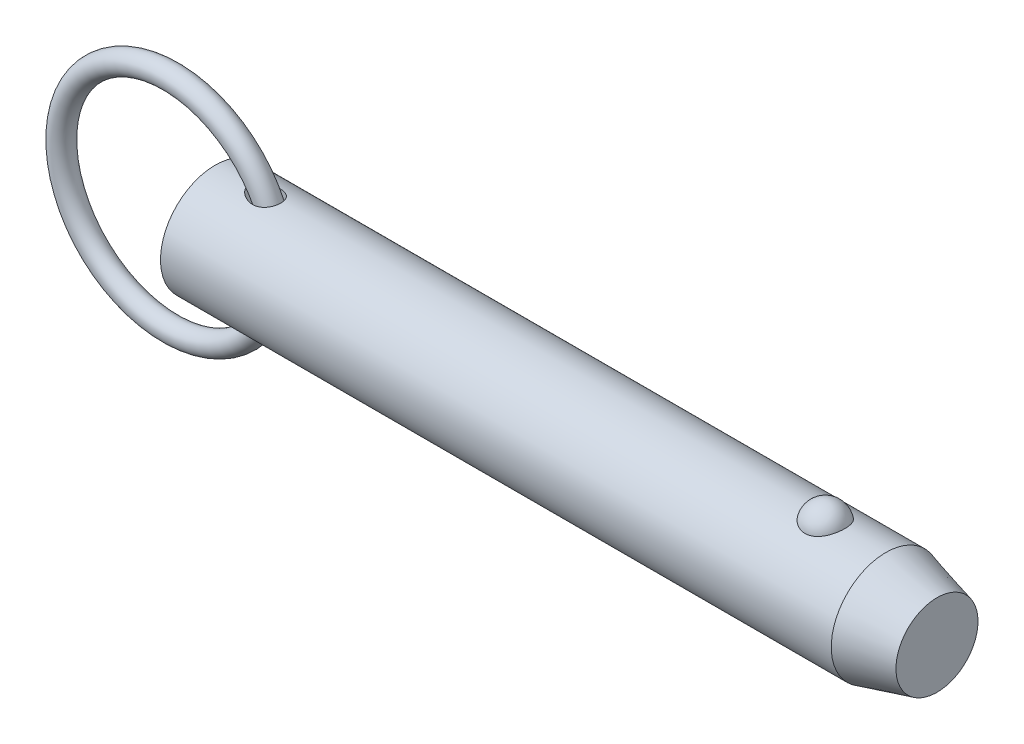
ISO-10303-21;
HEADER;
FILE_DESCRIPTION(('STEP AP214'),'2;1');
FILE_NAME('part.step','',(''),(''),'','','');
FILE_SCHEMA(('AUTOMOTIVE_DESIGN { 1 0 10303 214 1 1 1 1 }'));
ENDSEC;
DATA;
#1=APPLICATION_CONTEXT('core data for automotive mechanical design processes');
#2=APPLICATION_PROTOCOL_DEFINITION('international standard','automotive_design',2000,#1);
#3=PRODUCT_CONTEXT('',#1,'mechanical');
#4=PRODUCT('Part','Part','',(#3));
#5=PRODUCT_RELATED_PRODUCT_CATEGORY('part','',(#4));
#6=PRODUCT_DEFINITION_FORMATION('','',#4);
#7=PRODUCT_DEFINITION_CONTEXT('part definition',#1,'design');
#8=PRODUCT_DEFINITION('design','',#6,#7);
#9=PRODUCT_DEFINITION_SHAPE('','',#8);
#10=(LENGTH_UNIT() NAMED_UNIT(*) SI_UNIT(.MILLI.,.METRE.));
#11=(NAMED_UNIT(*) PLANE_ANGLE_UNIT() SI_UNIT($,.RADIAN.));
#12=(NAMED_UNIT(*) SI_UNIT($,.STERADIAN.) SOLID_ANGLE_UNIT());
#13=UNCERTAINTY_MEASURE_WITH_UNIT(LENGTH_MEASURE(1.E-05),#10,'distance_accuracy_value','');
#14=(GEOMETRIC_REPRESENTATION_CONTEXT(3) GLOBAL_UNCERTAINTY_ASSIGNED_CONTEXT((#13)) GLOBAL_UNIT_ASSIGNED_CONTEXT((#10,
#11,#12)) REPRESENTATION_CONTEXT('',''));
#15=CARTESIAN_POINT('',(0.,0.,0.));
#16=DIRECTION('',(0.,0.,1.));
#17=DIRECTION('',(1.,0.,0.));
#18=AXIS2_PLACEMENT_3D('',#15,#16,#17);
#19=CARTESIAN_POINT('',(-6.46799987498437,0.,0.));
#20=DIRECTION('',(0.,0.,1.));
#21=DIRECTION('',(1.,0.,0.));
#22=AXIS2_PLACEMENT_3D('',#19,#20,#21);
#23=TOROIDAL_SURFACE('',#22,15.875,1.588);
#24=CARTESIAN_POINT('',(10.9950001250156,0.,0.));
#25=VERTEX_POINT('',#24);
#26=VERTEX_LOOP('',#25);
#27=FACE_BOUND('',#26,.T.);
#28=ADVANCED_FACE('P0_F12',(#27),#23,.T.);
#29=CLOSED_SHELL('',(#28));
#30=MANIFOLD_SOLID_BREP('P0_B1',#29);
#31=CARTESIAN_POINT('',(0.,0.,0.));
#32=DIRECTION('',(1.,0.,0.));
#33=DIRECTION('',(0.,0.,-1.));
#34=AXIS2_PLACEMENT_3D('',#31,#32,#33);
#35=CYLINDRICAL_SURFACE('',#34,7.94);
#36=CARTESIAN_POINT('',(5.37881269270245,7.8641200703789,-1.0950869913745));
#37=CARTESIAN_POINT('',(5.49078530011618,7.84653010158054,-1.22142628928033));
#38=CARTESIAN_POINT('',(5.61742164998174,7.82766483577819,-1.33478448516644));
#39=CARTESIAN_POINT('',(5.82155225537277,7.80005811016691,-1.48501770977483));
#40=CARTESIAN_POINT('',(5.89211597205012,7.79095331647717,-1.53186949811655));
#41=CARTESIAN_POINT('',(6.03726296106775,7.77331484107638,-1.61899652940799));
#42=CARTESIAN_POINT('',(6.11184478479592,7.76478095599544,-1.65927412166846));
#43=CARTESIAN_POINT('',(6.31831542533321,7.74290334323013,-1.75933205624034));
#44=CARTESIAN_POINT('',(6.45343253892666,7.73042593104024,-1.81276183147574));
#45=CARTESIAN_POINT('',(6.73017339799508,7.70966096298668,-1.89912673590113));
#46=CARTESIAN_POINT('',(6.8717909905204,7.70136953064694,-1.93208083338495));
#47=CARTESIAN_POINT('',(7.17522096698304,7.6896684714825,-1.97820987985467));
#48=CARTESIAN_POINT('',(7.33750100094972,7.68691980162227,-1.98871513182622));
#49=CARTESIAN_POINT('',(7.5799424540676,7.68880305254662,-1.98137951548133));
#50=CARTESIAN_POINT('',(7.66059155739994,7.69043175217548,-1.97508575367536));
#51=CARTESIAN_POINT('',(7.82077465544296,7.69570110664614,-1.95445819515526));
#52=CARTESIAN_POINT('',(7.9003091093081,7.69934090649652,-1.94012781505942));
#53=CARTESIAN_POINT('',(8.09280087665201,7.71066069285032,-1.89475688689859));
#54=CARTESIAN_POINT('',(8.20465204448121,7.71942251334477,-1.85909462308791));
#55=CARTESIAN_POINT('',(8.42059371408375,7.74035594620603,-1.7699066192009));
#56=CARTESIAN_POINT('',(8.52468939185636,7.75252525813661,-1.7163929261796));
#57=CARTESIAN_POINT('',(8.72211003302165,7.77903750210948,-1.59192358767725));
#58=CARTESIAN_POINT('',(8.81539818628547,7.79338749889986,-1.52091076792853));
#59=CARTESIAN_POINT('',(8.98759177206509,7.8225086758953,-1.36321590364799));
#60=CARTESIAN_POINT('',(9.06649712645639,7.83727985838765,-1.27653377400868));
#61=CARTESIAN_POINT('',(9.20311499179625,7.86453692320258,-1.09567667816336));
#62=CARTESIAN_POINT('',(9.26180839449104,7.8771064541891,-1.00225329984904));
#63=CARTESIAN_POINT('',(9.36257622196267,7.89954213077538,-0.806547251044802));
#64=CARTESIAN_POINT('',(9.40465301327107,7.9094086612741,-0.704265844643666));
#65=CARTESIAN_POINT('',(9.47062404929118,7.92520709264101,-0.49546189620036));
#66=CARTESIAN_POINT('',(9.4947881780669,7.9311972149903,-0.389028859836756));
#67=CARTESIAN_POINT('',(9.52544004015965,7.93883641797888,-0.173494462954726));
#68=CARTESIAN_POINT('',(9.53192786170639,7.94048552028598,-0.0643931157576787));
#69=CARTESIAN_POINT('',(9.52707996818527,7.93926454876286,0.153487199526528));
#70=CARTESIAN_POINT('',(9.51572796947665,7.93639034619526,0.26226578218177));
#71=CARTESIAN_POINT('',(9.47542322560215,7.92642470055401,0.476313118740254));
#72=CARTESIAN_POINT('',(9.44647056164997,7.91933327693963,0.58158188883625));
#73=CARTESIAN_POINT('',(9.37164011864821,7.90170355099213,0.785602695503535));
#74=CARTESIAN_POINT('',(9.32576415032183,7.89116561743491,0.884355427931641));
#75=CARTESIAN_POINT('',(9.21823065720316,7.8677977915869,1.07254831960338));
#76=CARTESIAN_POINT('',(9.15657431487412,7.85496807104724,1.16198917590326));
#77=CARTESIAN_POINT('',(9.01919194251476,7.82843688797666,1.32903649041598));
#78=CARTESIAN_POINT('',(8.94347744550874,7.81473614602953,1.40665255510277));
#79=CARTESIAN_POINT('',(8.78012086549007,7.7879321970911,1.5481977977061));
#80=CARTESIAN_POINT('',(8.69247914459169,7.77482897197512,1.61212739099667));
#81=CARTESIAN_POINT('',(8.50642314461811,7.75037063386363,1.72592270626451));
#82=CARTESIAN_POINT('',(8.40786430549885,7.73904540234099,1.77555777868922));
#83=CARTESIAN_POINT('',(8.2039870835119,7.71943979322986,1.85894844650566));
#84=CARTESIAN_POINT('',(8.0986670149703,7.7111601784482,1.89270006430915));
#85=CARTESIAN_POINT('',(7.87703213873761,7.69782475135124,1.94625652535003));
#86=CARTESIAN_POINT('',(7.76044899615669,7.69301557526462,1.96500324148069));
#87=CARTESIAN_POINT('',(7.52574256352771,7.68770484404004,1.98567257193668));
#88=CARTESIAN_POINT('',(7.40761868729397,7.68720497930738,1.98758858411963));
#89=CARTESIAN_POINT('',(7.15639592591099,7.69044495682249,1.97502233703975));
#90=CARTESIAN_POINT('',(7.02341871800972,7.69476380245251,1.9583009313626));
#91=CARTESIAN_POINT('',(6.76125891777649,7.70776394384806,1.90648094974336));
#92=CARTESIAN_POINT('',(6.6320804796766,7.71644984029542,1.87136299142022));
#93=CARTESIAN_POINT('',(6.35978215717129,7.73875442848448,1.77707737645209));
#94=CARTESIAN_POINT('',(6.2177212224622,7.75293863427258,1.71496895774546));
#95=CARTESIAN_POINT('',(5.94559201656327,7.78383102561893,1.56880760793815));
#96=CARTESIAN_POINT('',(5.81552062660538,7.80053855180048,1.48476040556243));
#97=CARTESIAN_POINT('',(5.60081087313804,7.83035955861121,1.31701356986));
#98=CARTESIAN_POINT('',(5.51265224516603,7.84340226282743,1.23780647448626));
#99=CARTESIAN_POINT('',(5.34976240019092,7.86852524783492,1.06647953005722));
#100=CARTESIAN_POINT('',(5.27500719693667,7.88060722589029,0.974383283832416));
#101=CARTESIAN_POINT('',(5.15877594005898,7.89990441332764,0.800548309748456));
#102=CARTESIAN_POINT('',(5.11360209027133,7.90759876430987,0.721348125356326));
#103=CARTESIAN_POINT('',(5.03655060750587,7.92090267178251,0.55651819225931));
#104=CARTESIAN_POINT('',(5.00466157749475,7.92651401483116,0.470894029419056));
#105=CARTESIAN_POINT('',(4.95653766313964,7.93503671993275,0.294356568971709));
#106=CARTESIAN_POINT('',(4.94043621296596,7.93792505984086,0.203404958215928));
#107=CARTESIAN_POINT('',(4.92605720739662,7.94050250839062,0.0200631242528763));
#108=CARTESIAN_POINT('',(4.92776929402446,7.9401934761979,-0.0723262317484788));
#109=CARTESIAN_POINT('',(4.94742735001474,7.93667454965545,-0.243250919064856));
#110=CARTESIAN_POINT('',(4.96327131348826,7.93384031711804,-0.322048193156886));
#111=CARTESIAN_POINT('',(5.00707570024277,7.92609115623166,-0.476058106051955));
#112=CARTESIAN_POINT('',(5.03503965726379,7.92117562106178,-0.55126969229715));
#113=CARTESIAN_POINT('',(5.10737112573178,7.90866290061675,-0.709995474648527));
#114=CARTESIAN_POINT('',(5.15379379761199,7.90074105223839,-0.792541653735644));
#115=CARTESIAN_POINT('',(5.2582083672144,7.88338732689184,-0.949781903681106));
#116=CARTESIAN_POINT('',(5.31621941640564,7.87395295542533,-1.02446265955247));
#117=CARTESIAN_POINT('',(5.37881269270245,7.8641200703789,-1.0950869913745));
#118=B_SPLINE_CURVE_WITH_KNOTS('',3,(#36,#37,#38,#39,#40,#41,#42,#43,#44,#45,#46,#47,#48,#49,
#50,#51,#52,#53,#54,#55,#56,#57,#58,#59,#60,#61,#62,#63,#64,#65,#66,#67,#68,#69,#70,#71,#72,#73,
#74,#75,#76,#77,#78,#79,#80,#81,#82,#83,#84,#85,#86,#87,#88,#89,#90,#91,#92,#93,#94,#95,#96,#97,
#98,#99,#100,#101,#102,#103,#104,#105,#106,#107,#108,#109,#110,#111,#112,#113,#114,#115,#116,
#117),.UNSPECIFIED.,.T.,.F.,(4,2,2,2,2,2,2,2,2,2,2,2,2,2,2,2,2,2,2,2,2,2,2,2,2,2,2,2,2,2,2,2,2,
2,2,2,2,2,2,2,4),(0.,0.508599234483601,0.763935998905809,1.01918131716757,1.45492798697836,
1.89027038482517,2.37502798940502,2.61739702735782,2.85966310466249,3.21120678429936,
3.56251370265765,3.91498401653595,4.26745624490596,4.59897839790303,4.93045331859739,
5.2568264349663,5.58319792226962,5.909867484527,6.23653553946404,6.56316865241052,
6.88977729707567,7.21611917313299,7.54245114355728,7.87378632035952,8.20520442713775,
8.55832700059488,8.91158808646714,9.31234018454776,9.71351536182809,10.1786231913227,
10.6436096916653,11.0001264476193,11.3559986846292,11.6294791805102,11.9027245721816,
12.1782599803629,12.4536351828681,12.693828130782,12.9340911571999,13.2179277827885,
13.5022374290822),.UNSPECIFIED.);
#119=CARTESIAN_POINT('',(5.37881269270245,7.8641200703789,-1.0950869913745));
#120=VERTEX_POINT('',#119);
#121=EDGE_CURVE('P1_E40',#120,#120,#118,.T.);
#122=ORIENTED_EDGE('',*,*,#121,.T.);
#123=EDGE_LOOP('',(#122));
#124=FACE_BOUND('',#123,.T.);
#125=CARTESIAN_POINT('',(97.3718791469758,0.,0.));
#126=DIRECTION('',(1.,0.,0.));
#127=DIRECTION('',(0.,0.,-1.));
#128=AXIS2_PLACEMENT_3D('',#125,#126,#127);
#129=CIRCLE('',#128,7.94);
#130=CARTESIAN_POINT('',(97.3718791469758,0.,-7.94));
#131=VERTEX_POINT('',#130);
#132=EDGE_CURVE('P1_E25',#131,#131,#129,.T.);
#133=ORIENTED_EDGE('',*,*,#132,.F.);
#134=EDGE_LOOP('',(#133));
#135=FACE_BOUND('',#134,.T.);
#136=CARTESIAN_POINT('',(0.,0.,0.));
#137=DIRECTION('',(1.,0.,0.));
#138=DIRECTION('',(0.,0.,-1.));
#139=AXIS2_PLACEMENT_3D('',#136,#137,#138);
#140=CIRCLE('',#139,7.94);
#141=CARTESIAN_POINT('',(0.,0.,-7.94));
#142=VERTEX_POINT('',#141);
#143=EDGE_CURVE('P1_E9',#142,#142,#140,.T.);
#144=ORIENTED_EDGE('',*,*,#143,.T.);
#145=EDGE_LOOP('',(#144));
#146=FACE_BOUND('',#145,.T.);
#147=CARTESIAN_POINT('',(88.5649074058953,7.37767842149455,2.93486986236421));
#148=CARTESIAN_POINT('',(88.4127496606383,7.3776732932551,2.93487505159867));
#149=CARTESIAN_POINT('',(88.2606329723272,7.38258419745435,2.92262454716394));
#150=CARTESIAN_POINT('',(87.9609284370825,7.40163229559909,2.87404196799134));
#151=CARTESIAN_POINT('',(87.8133394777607,7.41576720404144,2.83771585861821));
#152=CARTESIAN_POINT('',(87.5270187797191,7.4516157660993,2.74218769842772));
#153=CARTESIAN_POINT('',(87.3882745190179,7.47331841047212,2.683018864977));
#154=CARTESIAN_POINT('',(87.1228822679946,7.52194082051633,2.5435096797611));
#155=CARTESIAN_POINT('',(86.9962366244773,7.5488615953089,2.46316523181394));
#156=CARTESIAN_POINT('',(86.7545349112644,7.60594671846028,2.28090375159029));
#157=CARTESIAN_POINT('',(86.6399065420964,7.63618114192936,2.17844211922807));
#158=CARTESIAN_POINT('',(86.4288787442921,7.69614046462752,1.95608495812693));
#159=CARTESIAN_POINT('',(86.3324826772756,7.72586526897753,1.83618622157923));
#160=CARTESIAN_POINT('',(86.1559381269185,7.78314821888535,1.57628086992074));
#161=CARTESIAN_POINT('',(86.0767072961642,7.81055035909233,1.43561546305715));
#162=CARTESIAN_POINT('',(85.9417979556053,7.85879631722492,1.14236334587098));
#163=CARTESIAN_POINT('',(85.8861216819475,7.87963951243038,0.989775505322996));
#164=CARTESIAN_POINT('',(85.7988121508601,7.91289645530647,0.674619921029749));
#165=CARTESIAN_POINT('',(85.7675309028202,7.925186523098,0.511941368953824));
#166=CARTESIAN_POINT('',(85.730975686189,7.93958930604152,0.183247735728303));
#167=CARTESIAN_POINT('',(85.7257012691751,7.94170219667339,0.0172327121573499));
#168=CARTESIAN_POINT('',(85.7412311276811,7.93554931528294,-0.312672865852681));
#169=CARTESIAN_POINT('',(85.7619253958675,7.92732732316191,-0.476569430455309));
#170=CARTESIAN_POINT('',(85.8287865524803,7.90141534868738,-0.798305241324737));
#171=CARTESIAN_POINT('',(85.8749539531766,7.88372517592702,-0.956144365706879));
#172=CARTESIAN_POINT('',(85.9918986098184,7.84066230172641,-1.26152073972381));
#173=CARTESIAN_POINT('',(86.0627046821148,7.81528060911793,-1.40904568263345));
#174=CARTESIAN_POINT('',(86.2274789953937,7.7594867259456,-1.68950598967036));
#175=CARTESIAN_POINT('',(86.3214488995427,7.72907417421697,-1.82244030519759));
#176=CARTESIAN_POINT('',(86.5308391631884,7.66640424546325,-2.07032792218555));
#177=CARTESIAN_POINT('',(86.6463152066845,7.63414223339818,-2.1852330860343));
#178=CARTESIAN_POINT('',(86.8959006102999,7.57149681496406,-2.39329737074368));
#179=CARTESIAN_POINT('',(87.0300080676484,7.54111321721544,-2.48645870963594));
#180=CARTESIAN_POINT('',(87.3101113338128,7.48650742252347,-2.64628132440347));
#181=CARTESIAN_POINT('',(87.4557605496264,7.46215900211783,-2.71350554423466));
#182=CARTESIAN_POINT('',(87.7574259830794,7.42171253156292,-2.82226614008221));
#183=CARTESIAN_POINT('',(87.9134383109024,7.40561140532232,-2.86381209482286));
#184=CARTESIAN_POINT('',(88.2229708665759,7.38426796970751,-2.91839077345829));
#185=CARTESIAN_POINT('',(88.3762229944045,7.37852109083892,-2.93275024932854));
#186=CARTESIAN_POINT('',(88.6830705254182,7.37700973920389,-2.9365520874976));
#187=CARTESIAN_POINT('',(88.8366658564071,7.38124333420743,-2.92599927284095));
#188=CARTESIAN_POINT('',(89.1349907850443,7.39890635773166,-2.88102897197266));
#189=CARTESIAN_POINT('',(89.2798480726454,7.41205491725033,-2.84733999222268));
#190=CARTESIAN_POINT('',(89.5616432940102,7.44580110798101,-2.75788206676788));
#191=CARTESIAN_POINT('',(89.6985805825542,7.46639934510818,-2.70211132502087));
#192=CARTESIAN_POINT('',(89.9640619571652,7.51339098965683,-2.56858908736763));
#193=CARTESIAN_POINT('',(90.0923548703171,7.53990200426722,-2.49038067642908));
#194=CARTESIAN_POINT('',(90.3342440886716,7.59569503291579,-2.31462737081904));
#195=CARTESIAN_POINT('',(90.4478370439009,7.62497767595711,-2.21707808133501));
#196=CARTESIAN_POINT('',(90.66322156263,7.68489473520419,-1.99982049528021));
#197=CARTESIAN_POINT('',(90.7641488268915,7.71552419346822,-1.87925337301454));
#198=CARTESIAN_POINT('',(90.9451866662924,7.77353016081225,-1.62268826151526));
#199=CARTESIAN_POINT('',(91.0252934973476,7.80090608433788,-1.48668750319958));
#200=CARTESIAN_POINT('',(91.1653615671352,7.85047992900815,-1.19818413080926));
#201=CARTESIAN_POINT('',(91.2245877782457,7.8724818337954,-1.04529016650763));
#202=CARTESIAN_POINT('',(91.3179821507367,7.90785114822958,-0.731080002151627));
#203=CARTESIAN_POINT('',(91.3521497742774,7.92121837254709,-0.569763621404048));
#204=CARTESIAN_POINT('',(91.394795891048,7.93797834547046,-0.242812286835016));
#205=CARTESIAN_POINT('',(91.4032047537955,7.94134405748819,-0.0771668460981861));
#206=CARTESIAN_POINT('',(91.3939626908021,7.93767937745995,0.253276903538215));
#207=CARTESIAN_POINT('',(91.3763120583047,7.93064910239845,0.418075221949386));
#208=CARTESIAN_POINT('',(91.3154247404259,7.90695571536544,0.741525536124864));
#209=CARTESIAN_POINT('',(91.2722819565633,7.8903279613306,0.90019782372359));
#210=CARTESIAN_POINT('',(91.1613535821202,7.84916386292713,1.20759654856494));
#211=CARTESIAN_POINT('',(91.0935665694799,7.82462706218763,1.35632241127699));
#212=CARTESIAN_POINT('',(90.9343718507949,7.7700669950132,1.64032869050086));
#213=CARTESIAN_POINT('',(90.8428616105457,7.7400200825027,1.77554712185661));
#214=CARTESIAN_POINT('',(90.6382960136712,7.67774175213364,2.02800648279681));
#215=CARTESIAN_POINT('',(90.5252410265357,7.64551037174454,2.14524772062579));
#216=CARTESIAN_POINT('',(90.2808318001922,7.58265895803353,2.35778002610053));
#217=CARTESIAN_POINT('',(90.1495833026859,7.5520309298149,2.45319004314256));
#218=CARTESIAN_POINT('',(89.871601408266,7.49579792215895,2.61999897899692));
#219=CARTESIAN_POINT('',(89.7248670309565,7.4701932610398,2.69139637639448));
#220=CARTESIAN_POINT('',(89.4129477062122,7.42622216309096,2.81053241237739));
#221=CARTESIAN_POINT('',(89.2472209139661,7.40825002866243,2.85700910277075));
#222=CARTESIAN_POINT('',(88.9092792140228,7.38398348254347,2.91916850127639));
#223=CARTESIAN_POINT('',(88.7370670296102,7.37768422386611,2.93486399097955));
#224=CARTESIAN_POINT('',(88.5649074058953,7.37767842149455,2.93486986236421));
#225=B_SPLINE_CURVE_WITH_KNOTS('',3,(#147,#148,#149,#150,#151,#152,#153,#154,#155,#156,#157,
#158,#159,#160,#161,#162,#163,#164,#165,#166,#167,#168,#169,#170,#171,#172,#173,#174,#175,#176,
#177,#178,#179,#180,#181,#182,#183,#184,#185,#186,#187,#188,#189,#190,#191,#192,#193,#194,#195,
#196,#197,#198,#199,#200,#201,#202,#203,#204,#205,#206,#207,#208,#209,#210,#211,#212,#213,#214,
#215,#216,#217,#218,#219,#220,#221,#222,#223,#224),.UNSPECIFIED.,.T.,.F.,(4,2,2,2,2,2,2,2,2,2,2,
2,2,2,2,2,2,2,2,2,2,2,2,2,2,2,2,2,2,2,2,2,2,2,2,2,2,2,4),(0.,0.455841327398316,
0.911569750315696,1.36663794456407,1.8217942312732,2.28978983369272,2.75787163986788,
3.24685368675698,3.73588214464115,4.23184282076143,4.72779494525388,5.22165321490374,
5.71552141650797,6.20996917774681,6.70445245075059,7.20023431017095,7.69596557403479,
8.18023418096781,8.66432203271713,9.1241069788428,9.58380291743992,10.0296503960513,
10.4755341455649,10.9312349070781,11.3870393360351,11.8654416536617,12.343929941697,
12.837887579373,13.3318558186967,13.8271581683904,14.3224549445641,14.8159385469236,
15.309450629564,15.8051323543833,16.3008055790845,16.7937101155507,17.2866458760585,
17.8026240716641,18.3183879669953),.UNSPECIFIED.);
#226=CARTESIAN_POINT('',(88.5649074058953,7.37767842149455,2.93486986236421));
#227=VERTEX_POINT('',#226);
#228=EDGE_CURVE('P1_E34',#227,#227,#225,.T.);
#229=ORIENTED_EDGE('',*,*,#228,.T.);
#230=EDGE_LOOP('',(#229));
#231=FACE_BOUND('',#230,.T.);
#232=CARTESIAN_POINT('',(5.37881269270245,-7.8641200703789,-1.0950869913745));
#233=CARTESIAN_POINT('',(5.31532711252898,-7.87409326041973,-1.02345575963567));
#234=CARTESIAN_POINT('',(5.25654962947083,-7.88365715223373,-0.947641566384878));
#235=CARTESIAN_POINT('',(5.15093536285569,-7.90122221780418,-0.787865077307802));
#236=CARTESIAN_POINT('',(5.10408931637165,-7.90922460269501,-0.703909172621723));
#237=CARTESIAN_POINT('',(5.02499142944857,-7.92292057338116,-0.527991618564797));
#238=CARTESIAN_POINT('',(4.99290048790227,-7.92858863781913,-0.435954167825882));
#239=CARTESIAN_POINT('',(4.94718343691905,-7.93670712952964,-0.247266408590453));
#240=CARTESIAN_POINT('',(4.93353142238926,-7.93916207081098,-0.150622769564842));
#241=CARTESIAN_POINT('',(4.92669426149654,-7.94038957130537,0.03064599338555));
#242=CARTESIAN_POINT('',(4.9310562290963,-7.93960347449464,0.115182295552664));
#243=CARTESIAN_POINT('',(4.95441758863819,-7.93542535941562,0.282133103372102));
#244=CARTESIAN_POINT('',(4.97342060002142,-7.93203269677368,0.364547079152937));
#245=CARTESIAN_POINT('',(5.02337664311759,-7.92322764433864,0.521528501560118));
#246=CARTESIAN_POINT('',(5.05377582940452,-7.91790920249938,0.596281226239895));
#247=CARTESIAN_POINT('',(5.1246872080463,-7.90571364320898,0.740640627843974));
#248=CARTESIAN_POINT('',(5.16520358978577,-7.89883588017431,0.810245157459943));
#249=CARTESIAN_POINT('',(5.27792634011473,-7.88012470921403,0.978620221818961));
#250=CARTESIAN_POINT('',(5.35563200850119,-7.86757912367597,1.07363778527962));
#251=CARTESIAN_POINT('',(5.52523836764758,-7.84150676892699,1.24994147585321));
#252=CARTESIAN_POINT('',(5.61717506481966,-7.82797755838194,1.33119164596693));
#253=CARTESIAN_POINT('',(5.83913717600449,-7.79742756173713,1.50104748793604));
#254=CARTESIAN_POINT('',(5.9725742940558,-7.78050347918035,1.58521567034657));
#255=CARTESIAN_POINT('',(6.25160600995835,-7.74942135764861,1.73078109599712));
#256=CARTESIAN_POINT('',(6.39720857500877,-7.73526515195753,1.79216327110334));
#257=CARTESIAN_POINT('',(6.69793322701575,-7.7116170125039,1.89134478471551));
#258=CARTESIAN_POINT('',(6.85312134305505,-7.70216275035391,1.92895428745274));
#259=CARTESIAN_POINT('',(7.16781951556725,-7.68988337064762,1.97736316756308));
#260=CARTESIAN_POINT('',(7.32732244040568,-7.68704791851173,1.98820434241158));
#261=CARTESIAN_POINT('',(7.61290770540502,-7.68890797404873,1.98097687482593));
#262=CARTESIAN_POINT('',(7.73913797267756,-7.69217875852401,1.96837928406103));
#263=CARTESIAN_POINT('',(7.98774248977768,-7.70364253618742,1.92303262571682));
#264=CARTESIAN_POINT('',(8.11011880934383,-7.71183283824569,1.89029457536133));
#265=CARTESIAN_POINT('',(8.34766306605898,-7.73253074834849,1.80375920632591));
#266=CARTESIAN_POINT('',(8.46278682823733,-7.74506226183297,1.74984505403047));
#267=CARTESIAN_POINT('',(8.6806268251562,-7.77294147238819,1.62149891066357));
#268=CARTESIAN_POINT('',(8.78334736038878,-7.78828818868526,1.54707406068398));
#269=CARTESIAN_POINT('',(8.96275951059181,-7.81808719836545,1.38814746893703));
#270=CARTESIAN_POINT('',(9.0410292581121,-7.83247448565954,1.30540890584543));
#271=CARTESIAN_POINT('',(9.18176824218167,-7.86008608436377,1.1272733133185));
#272=CARTESIAN_POINT('',(9.24424163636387,-7.87331070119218,1.03187962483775));
#273=CARTESIAN_POINT('',(9.34924815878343,-7.89649032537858,0.835684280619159));
#274=CARTESIAN_POINT('',(9.39252490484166,-7.90656172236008,0.73529314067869));
#275=CARTESIAN_POINT('',(9.46188913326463,-7.92307290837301,0.528458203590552));
#276=CARTESIAN_POINT('',(9.48797767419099,-7.92951292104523,0.422014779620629));
#277=CARTESIAN_POINT('',(9.5222867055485,-7.93804067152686,0.206589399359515));
#278=CARTESIAN_POINT('',(9.53058328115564,-7.94014694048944,0.0976202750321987));
#279=CARTESIAN_POINT('',(9.52935292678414,-7.93983698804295,-0.120212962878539));
#280=CARTESIAN_POINT('',(9.51982577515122,-7.9374207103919,-0.229077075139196));
#281=CARTESIAN_POINT('',(9.48313466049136,-7.92831916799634,-0.443751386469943));
#282=CARTESIAN_POINT('',(9.45594838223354,-7.92162850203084,-0.549557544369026));
#283=CARTESIAN_POINT('',(9.3845465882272,-7.90469917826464,-0.754954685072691));
#284=CARTESIAN_POINT('',(9.34033171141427,-7.89446065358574,-0.854545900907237));
#285=CARTESIAN_POINT('',(9.23602927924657,-7.87157146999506,-1.04456732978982));
#286=CARTESIAN_POINT('',(9.17596171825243,-7.85892385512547,-1.13500888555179));
#287=CARTESIAN_POINT('',(9.04153430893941,-7.83259746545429,-1.30436780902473));
#288=CARTESIAN_POINT('',(8.96717562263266,-7.81891877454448,-1.38328611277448));
#289=CARTESIAN_POINT('',(8.80603455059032,-7.79196869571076,-1.52782923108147));
#290=CARTESIAN_POINT('',(8.71921490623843,-7.77869867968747,-1.59341269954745));
#291=CARTESIAN_POINT('',(8.53589430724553,-7.7539823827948,-1.7096493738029));
#292=CARTESIAN_POINT('',(8.43939269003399,-7.74253622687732,-1.76030155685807));
#293=CARTESIAN_POINT('',(8.23614706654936,-7.72219212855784,-1.84754820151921));
#294=CARTESIAN_POINT('',(8.12916866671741,-7.71339202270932,-1.88361685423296));
#295=CARTESIAN_POINT('',(7.91082287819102,-7.69955300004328,-1.93940887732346));
#296=CARTESIAN_POINT('',(7.79945379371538,-7.69451555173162,-1.95912586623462));
#297=CARTESIAN_POINT('',(7.56409927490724,-7.6881073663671,-1.98413612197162));
#298=CARTESIAN_POINT('',(7.43993744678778,-7.68713944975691,-1.98784574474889));
#299=CARTESIAN_POINT('',(7.19239878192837,-7.68969629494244,-1.97792309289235));
#300=CARTESIAN_POINT('',(7.0690222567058,-7.69322274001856,-1.96428432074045));
#301=CARTESIAN_POINT('',(6.80624991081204,-7.70498367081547,-1.91768089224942));
#302=CARTESIAN_POINT('',(6.667361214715,-7.71386737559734,-1.88203087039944));
#303=CARTESIAN_POINT('',(6.39625444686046,-7.73551250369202,-1.79098714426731));
#304=CARTESIAN_POINT('',(6.26404857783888,-7.74828074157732,-1.73555871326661));
#305=CARTESIAN_POINT('',(6.06559048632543,-7.77003865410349,-1.63446133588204));
#306=CARTESIAN_POINT('',(5.99591479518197,-7.77821880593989,-1.59522999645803));
#307=CARTESIAN_POINT('',(5.86025875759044,-7.79503524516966,-1.51091846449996));
#308=CARTESIAN_POINT('',(5.79427944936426,-7.80367165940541,-1.46583664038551));
#309=CARTESIAN_POINT('',(5.60322733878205,-7.82978128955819,-1.3219827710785));
#310=CARTESIAN_POINT('',(5.48449649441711,-7.84751780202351,-1.21433077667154));
#311=CARTESIAN_POINT('',(5.37881269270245,-7.8641200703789,-1.0950869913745));
#312=B_SPLINE_CURVE_WITH_KNOTS('',3,(#232,#233,#234,#235,#236,#237,#238,#239,#240,#241,#242,
#243,#244,#245,#246,#247,#248,#249,#250,#251,#252,#253,#254,#255,#256,#257,#258,#259,#260,#261,
#262,#263,#264,#265,#266,#267,#268,#269,#270,#271,#272,#273,#274,#275,#276,#277,#278,#279,#280,
#281,#282,#283,#284,#285,#286,#287,#288,#289,#290,#291,#292,#293,#294,#295,#296,#297,#298,#299,
#300,#301,#302,#303,#304,#305,#306,#307,#308,#309,#310,#311),.UNSPECIFIED.,.T.,.F.,(4,2,2,2,2,2,
2,2,2,2,2,2,2,2,2,2,2,2,2,2,2,2,2,2,2,2,2,2,2,2,2,2,2,2,2,2,2,2,2,4),(0.,0.288363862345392,
0.576503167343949,0.867714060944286,1.15851540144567,1.41111828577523,1.66378363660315,
1.90549406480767,2.1473047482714,2.51540453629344,2.88445136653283,3.35805159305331,
3.83196445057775,4.30961543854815,4.78652012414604,5.16565662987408,5.54458592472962,
5.92563591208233,6.30655339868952,6.64920782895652,6.99177197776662,7.31956587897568,
7.64733959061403,7.97370879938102,8.30008206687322,8.62686856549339,8.95364280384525,
9.28000684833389,9.60634436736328,9.93367879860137,10.261035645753,10.59932199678,
10.9377403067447,11.308967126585,11.6803330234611,12.1096921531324,12.5398088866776,
12.7806650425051,13.0215885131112,13.5016249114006),.UNSPECIFIED.);
#313=CARTESIAN_POINT('',(5.37881269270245,-7.8641200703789,-1.0950869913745));
#314=VERTEX_POINT('',#313);
#315=EDGE_CURVE('P1_E17',#314,#314,#312,.T.);
#316=ORIENTED_EDGE('',*,*,#315,.T.);
#317=EDGE_LOOP('',(#316));
#318=FACE_BOUND('',#317,.T.);
#319=ADVANCED_FACE('P1_F13',(#124,#135,#146,#231,#318),#35,.T.);
#320=CARTESIAN_POINT('',(0.,0.,0.));
#321=DIRECTION('',(-1.,0.,0.));
#322=DIRECTION('',(0.,0.,1.));
#323=AXIS2_PLACEMENT_3D('',#320,#321,#322);
#324=PLANE('',#323);
#325=ORIENTED_EDGE('',*,*,#143,.F.);
#326=EDGE_LOOP('',(#325));
#327=FACE_BOUND('',#326,.T.);
#328=ADVANCED_FACE('P1_F15',(#327),#324,.T.);
#329=CARTESIAN_POINT('',(104.78,0.,0.));
#330=DIRECTION('',(-1.,0.,0.));
#331=DIRECTION('',(0.,0.,1.));
#332=AXIS2_PLACEMENT_3D('',#329,#330,#331);
#333=CONICAL_SURFACE('',#332,5.95500000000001,0.26179938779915);
#334=ORIENTED_EDGE('',*,*,#132,.T.);
#335=EDGE_LOOP('',(#334));
#336=FACE_BOUND('',#335,.T.);
#337=CARTESIAN_POINT('',(104.78,0.,0.));
#338=DIRECTION('',(1.,0.,0.));
#339=DIRECTION('',(0.,0.,-1.));
#340=AXIS2_PLACEMENT_3D('',#337,#338,#339);
#341=CIRCLE('',#340,5.95500000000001);
#342=CARTESIAN_POINT('',(104.78,0.,-5.95500000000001));
#343=VERTEX_POINT('',#342);
#344=EDGE_CURVE('P1_E30',#343,#343,#341,.T.);
#345=ORIENTED_EDGE('',*,*,#344,.F.);
#346=EDGE_LOOP('',(#345));
#347=FACE_BOUND('',#346,.T.);
#348=ADVANCED_FACE('P1_F55',(#336,#347),#333,.T.);
#349=CARTESIAN_POINT('',(104.78,5.95500000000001,0.));
#350=DIRECTION('',(1.,0.,0.));
#351=DIRECTION('',(0.,0.,-1.));
#352=AXIS2_PLACEMENT_3D('',#349,#350,#351);
#353=PLANE('',#352);
#354=ORIENTED_EDGE('',*,*,#344,.T.);
#355=EDGE_LOOP('',(#354));
#356=FACE_BOUND('',#355,.T.);
#357=ADVANCED_FACE('P1_F51',(#356),#353,.T.);
#358=CARTESIAN_POINT('',(88.5649074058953,7.146,0.));
#359=DIRECTION('',(-1.,0.,0.));
#360=DIRECTION('',(0.,-1.,0.));
#361=AXIS2_PLACEMENT_3D('',#358,#359,#360);
#362=SPHERICAL_SURFACE('',#361,2.94399999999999);
#363=ORIENTED_EDGE('',*,*,#228,.F.);
#364=EDGE_LOOP('',(#363));
#365=FACE_BOUND('',#364,.T.);
#366=ADVANCED_FACE('P1_F46',(#365),#362,.T.);
#367=CARTESIAN_POINT('',(-6.46799987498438,0.,0.));
#368=DIRECTION('',(0.,0.,1.));
#369=DIRECTION('',(1.,0.,0.));
#370=AXIS2_PLACEMENT_3D('',#367,#368,#369);
#371=TOROIDAL_SURFACE('',#370,15.875,1.985);
#372=ORIENTED_EDGE('',*,*,#315,.F.);
#373=EDGE_LOOP('',(#372));
#374=FACE_BOUND('',#373,.T.);
#375=ORIENTED_EDGE('',*,*,#121,.F.);
#376=EDGE_LOOP('',(#375));
#377=FACE_BOUND('',#376,.T.);
#378=ADVANCED_FACE('P1_F50',(#374,#377),#371,.F.);
#379=CLOSED_SHELL('',(#319,#328,#348,#357,#366,#378));
#380=MANIFOLD_SOLID_BREP('P1_B1',#379);
#381=ADVANCED_BREP_SHAPE_REPRESENTATION('',(#18,#30,#380),#14);
#382=SHAPE_DEFINITION_REPRESENTATION(#9,#381);
ENDSEC;
END-ISO-10303-21;
